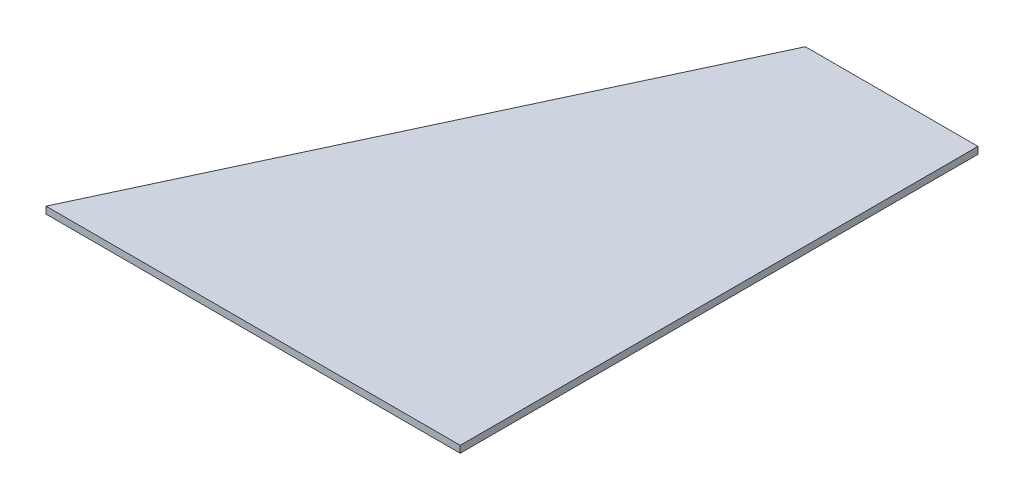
ISO-10303-21;
HEADER;
FILE_DESCRIPTION(('STEP AP214'),'2;1');
FILE_NAME('part.step','',(''),(''),'','','');
FILE_SCHEMA(('AUTOMOTIVE_DESIGN { 1 0 10303 214 1 1 1 1 }'));
ENDSEC;
DATA;
#1=APPLICATION_CONTEXT('core data for automotive mechanical design processes');
#2=APPLICATION_PROTOCOL_DEFINITION('international standard','automotive_design',2000,#1);
#3=PRODUCT_CONTEXT('',#1,'mechanical');
#4=PRODUCT('Part','Part','',(#3));
#5=PRODUCT_RELATED_PRODUCT_CATEGORY('part','',(#4));
#6=PRODUCT_DEFINITION_FORMATION('','',#4);
#7=PRODUCT_DEFINITION_CONTEXT('part definition',#1,'design');
#8=PRODUCT_DEFINITION('design','',#6,#7);
#9=PRODUCT_DEFINITION_SHAPE('','',#8);
#10=(LENGTH_UNIT() NAMED_UNIT(*) SI_UNIT(.MILLI.,.METRE.));
#11=(NAMED_UNIT(*) PLANE_ANGLE_UNIT() SI_UNIT($,.RADIAN.));
#12=(NAMED_UNIT(*) SI_UNIT($,.STERADIAN.) SOLID_ANGLE_UNIT());
#13=UNCERTAINTY_MEASURE_WITH_UNIT(LENGTH_MEASURE(1.E-05),#10,'distance_accuracy_value','');
#14=(GEOMETRIC_REPRESENTATION_CONTEXT(3) GLOBAL_UNCERTAINTY_ASSIGNED_CONTEXT((#13)) GLOBAL_UNIT_ASSIGNED_CONTEXT((#10,
#11,#12)) REPRESENTATION_CONTEXT('',''));
#15=CARTESIAN_POINT('',(0.,0.,0.));
#16=DIRECTION('',(0.,0.,1.));
#17=DIRECTION('',(1.,0.,0.));
#18=AXIS2_PLACEMENT_3D('',#15,#16,#17);
#19=CARTESIAN_POINT('',(35.,1.,-75.));
#20=DIRECTION('',(0.906183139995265,0.,0.422885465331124));
#21=DIRECTION('',(0.422885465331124,0.,-0.906183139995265));
#22=AXIS2_PLACEMENT_3D('',#19,#20,#21);
#23=PLANE('',#22);
#24=DIRECTION('',(-0.422885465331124,0.,0.906183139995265));
#25=VECTOR('',#24,1.);
#26=CARTESIAN_POINT('',(35.,0.,-75.));
#27=LINE('',#26,#25);
#28=CARTESIAN_POINT('',(35.,0.,-75.));
#29=VERTEX_POINT('',#28);
#30=CARTESIAN_POINT('',(0.,0.,0.));
#31=VERTEX_POINT('',#30);
#32=EDGE_CURVE('E78',#29,#31,#27,.T.);
#33=ORIENTED_EDGE('',*,*,#32,.T.);
#34=DIRECTION('',(0.,-1.,0.));
#35=VECTOR('',#34,1.);
#36=CARTESIAN_POINT('',(0.,1.,0.));
#37=LINE('',#36,#35);
#38=CARTESIAN_POINT('',(0.,1.,0.));
#39=VERTEX_POINT('',#38);
#40=EDGE_CURVE('E11',#39,#31,#37,.T.);
#41=ORIENTED_EDGE('',*,*,#40,.F.);
#42=DIRECTION('',(-0.422885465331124,0.,0.906183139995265));
#43=VECTOR('',#42,1.);
#44=CARTESIAN_POINT('',(35.,1.,-75.));
#45=LINE('',#44,#43);
#46=CARTESIAN_POINT('',(35.,1.,-75.));
#47=VERTEX_POINT('',#46);
#48=EDGE_CURVE('E96',#47,#39,#45,.T.);
#49=ORIENTED_EDGE('',*,*,#48,.F.);
#50=DIRECTION('',(0.,-1.,0.));
#51=VECTOR('',#50,1.);
#52=CARTESIAN_POINT('',(35.,1.,-75.));
#53=LINE('',#52,#51);
#54=EDGE_CURVE('E90',#47,#29,#53,.T.);
#55=ORIENTED_EDGE('',*,*,#54,.T.);
#56=EDGE_LOOP('',(#33,#41,#49,#55));
#57=FACE_BOUND('',#56,.T.);
#58=ADVANCED_FACE('F34',(#57),#23,.F.);
#59=CARTESIAN_POINT('',(0.,1.,0.));
#60=DIRECTION('',(0.,0.,-1.));
#61=DIRECTION('',(-1.,0.,0.));
#62=AXIS2_PLACEMENT_3D('',#59,#60,#61);
#63=PLANE('',#62);
#64=DIRECTION('',(1.,0.,0.));
#65=VECTOR('',#64,1.);
#66=CARTESIAN_POINT('',(0.,0.,0.));
#67=LINE('',#66,#65);
#68=CARTESIAN_POINT('',(60.,0.,0.));
#69=VERTEX_POINT('',#68);
#70=EDGE_CURVE('E74',#31,#69,#67,.T.);
#71=ORIENTED_EDGE('',*,*,#70,.T.);
#72=DIRECTION('',(0.,-1.,0.));
#73=VECTOR('',#72,1.);
#74=CARTESIAN_POINT('',(60.,1.,0.));
#75=LINE('',#74,#73);
#76=CARTESIAN_POINT('',(60.,1.,0.));
#77=VERTEX_POINT('',#76);
#78=EDGE_CURVE('E41',#77,#69,#75,.T.);
#79=ORIENTED_EDGE('',*,*,#78,.F.);
#80=DIRECTION('',(1.,0.,0.));
#81=VECTOR('',#80,1.);
#82=CARTESIAN_POINT('',(0.,1.,0.));
#83=LINE('',#82,#81);
#84=EDGE_CURVE('E86',#39,#77,#83,.T.);
#85=ORIENTED_EDGE('',*,*,#84,.F.);
#86=ORIENTED_EDGE('',*,*,#40,.T.);
#87=EDGE_LOOP('',(#71,#79,#85,#86));
#88=FACE_BOUND('',#87,.T.);
#89=ADVANCED_FACE('F85',(#88),#63,.F.);
#90=CARTESIAN_POINT('',(60.,1.,0.));
#91=DIRECTION('',(-1.,0.,0.));
#92=DIRECTION('',(0.,0.,1.));
#93=AXIS2_PLACEMENT_3D('',#90,#91,#92);
#94=PLANE('',#93);
#95=DIRECTION('',(0.,0.,-1.));
#96=VECTOR('',#95,1.);
#97=CARTESIAN_POINT('',(60.,0.,0.));
#98=LINE('',#97,#96);
#99=CARTESIAN_POINT('',(60.,0.,-75.));
#100=VERTEX_POINT('',#99);
#101=EDGE_CURVE('E79',#69,#100,#98,.T.);
#102=ORIENTED_EDGE('',*,*,#101,.T.);
#103=DIRECTION('',(0.,-1.,0.));
#104=VECTOR('',#103,1.);
#105=CARTESIAN_POINT('',(60.,1.,-75.));
#106=LINE('',#105,#104);
#107=CARTESIAN_POINT('',(60.,1.,-75.));
#108=VERTEX_POINT('',#107);
#109=EDGE_CURVE('E102',#108,#100,#106,.T.);
#110=ORIENTED_EDGE('',*,*,#109,.F.);
#111=DIRECTION('',(0.,0.,-1.));
#112=VECTOR('',#111,1.);
#113=CARTESIAN_POINT('',(60.,1.,0.));
#114=LINE('',#113,#112);
#115=EDGE_CURVE('E53',#77,#108,#114,.T.);
#116=ORIENTED_EDGE('',*,*,#115,.F.);
#117=ORIENTED_EDGE('',*,*,#78,.T.);
#118=EDGE_LOOP('',(#102,#110,#116,#117));
#119=FACE_BOUND('',#118,.T.);
#120=ADVANCED_FACE('F105',(#119),#94,.F.);
#121=CARTESIAN_POINT('',(60.,1.,-75.));
#122=DIRECTION('',(0.,0.,1.));
#123=DIRECTION('',(1.,0.,0.));
#124=AXIS2_PLACEMENT_3D('',#121,#122,#123);
#125=PLANE('',#124);
#126=DIRECTION('',(-1.,0.,0.));
#127=VECTOR('',#126,1.);
#128=CARTESIAN_POINT('',(60.,0.,-75.));
#129=LINE('',#128,#127);
#130=EDGE_CURVE('E94',#100,#29,#129,.T.);
#131=ORIENTED_EDGE('',*,*,#130,.T.);
#132=ORIENTED_EDGE('',*,*,#54,.F.);
#133=DIRECTION('',(-1.,0.,0.));
#134=VECTOR('',#133,1.);
#135=CARTESIAN_POINT('',(60.,1.,-75.));
#136=LINE('',#135,#134);
#137=EDGE_CURVE('E48',#108,#47,#136,.T.);
#138=ORIENTED_EDGE('',*,*,#137,.F.);
#139=ORIENTED_EDGE('',*,*,#109,.T.);
#140=EDGE_LOOP('',(#131,#132,#138,#139));
#141=FACE_BOUND('',#140,.T.);
#142=ADVANCED_FACE('F107',(#141),#125,.F.);
#143=CARTESIAN_POINT('',(0.,1.,0.));
#144=DIRECTION('',(0.,1.,0.));
#145=DIRECTION('',(0.,0.,1.));
#146=AXIS2_PLACEMENT_3D('',#143,#144,#145);
#147=PLANE('',#146);
#148=ORIENTED_EDGE('',*,*,#48,.T.);
#149=ORIENTED_EDGE('',*,*,#84,.T.);
#150=ORIENTED_EDGE('',*,*,#115,.T.);
#151=ORIENTED_EDGE('',*,*,#137,.T.);
#152=EDGE_LOOP('',(#148,#149,#150,#151));
#153=FACE_BOUND('',#152,.T.);
#154=ADVANCED_FACE('F108',(#153),#147,.T.);
#155=CARTESIAN_POINT('',(0.,0.,0.));
#156=DIRECTION('',(0.,1.,0.));
#157=DIRECTION('',(0.,0.,1.));
#158=AXIS2_PLACEMENT_3D('',#155,#156,#157);
#159=PLANE('',#158);
#160=ORIENTED_EDGE('',*,*,#32,.F.);
#161=ORIENTED_EDGE('',*,*,#130,.F.);
#162=ORIENTED_EDGE('',*,*,#101,.F.);
#163=ORIENTED_EDGE('',*,*,#70,.F.);
#164=EDGE_LOOP('',(#160,#161,#162,#163));
#165=FACE_BOUND('',#164,.T.);
#166=ADVANCED_FACE('F75',(#165),#159,.F.);
#167=CLOSED_SHELL('',(#58,#89,#120,#142,#154,#166));
#168=MANIFOLD_SOLID_BREP('B2',#167);
#169=ADVANCED_BREP_SHAPE_REPRESENTATION('',(#18,#168),#14);
#170=SHAPE_DEFINITION_REPRESENTATION(#9,#169);
ENDSEC;
END-ISO-10303-21;
